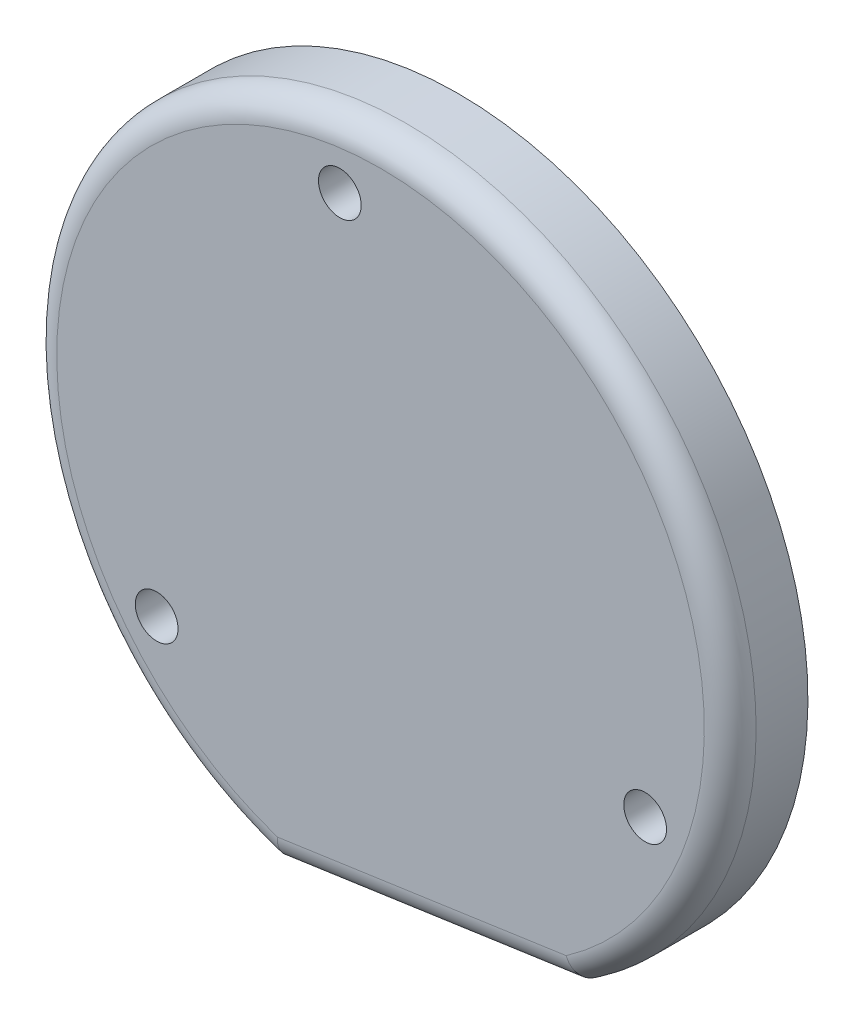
ISO-10303-21;
HEADER;
FILE_DESCRIPTION(('STEP AP214'),'2;1');
FILE_NAME('part.step','',(''),(''),'','','');
FILE_SCHEMA(('AUTOMOTIVE_DESIGN { 1 0 10303 214 1 1 1 1 }'));
ENDSEC;
DATA;
#1=APPLICATION_CONTEXT('core data for automotive mechanical design processes');
#2=APPLICATION_PROTOCOL_DEFINITION('international standard','automotive_design',2000,#1);
#3=PRODUCT_CONTEXT('',#1,'mechanical');
#4=PRODUCT('Part','Part','',(#3));
#5=PRODUCT_RELATED_PRODUCT_CATEGORY('part','',(#4));
#6=PRODUCT_DEFINITION_FORMATION('','',#4);
#7=PRODUCT_DEFINITION_CONTEXT('part definition',#1,'design');
#8=PRODUCT_DEFINITION('design','',#6,#7);
#9=PRODUCT_DEFINITION_SHAPE('','',#8);
#10=(LENGTH_UNIT() NAMED_UNIT(*) SI_UNIT(.MILLI.,.METRE.));
#11=(NAMED_UNIT(*) PLANE_ANGLE_UNIT() SI_UNIT($,.RADIAN.));
#12=(NAMED_UNIT(*) SI_UNIT($,.STERADIAN.) SOLID_ANGLE_UNIT());
#13=UNCERTAINTY_MEASURE_WITH_UNIT(LENGTH_MEASURE(1.E-05),#10,'distance_accuracy_value','');
#14=(GEOMETRIC_REPRESENTATION_CONTEXT(3) GLOBAL_UNCERTAINTY_ASSIGNED_CONTEXT((#13)) GLOBAL_UNIT_ASSIGNED_CONTEXT((#10,
#11,#12)) REPRESENTATION_CONTEXT('',''));
#15=CARTESIAN_POINT('',(0.,0.,0.));
#16=DIRECTION('',(0.,0.,1.));
#17=DIRECTION('',(1.,0.,0.));
#18=AXIS2_PLACEMENT_3D('',#15,#16,#17);
#19=CARTESIAN_POINT('',(0.,0.,56.2474746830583));
#20=DIRECTION('',(0.,0.,-1.));
#21=DIRECTION('',(-1.,0.,0.));
#22=AXIS2_PLACEMENT_3D('',#19,#20,#21);
#23=CYLINDRICAL_SURFACE('',#22,17.5);
#24=CARTESIAN_POINT('',(0.,0.,0.));
#25=DIRECTION('',(0.,0.,1.));
#26=DIRECTION('',(1.,0.,0.));
#27=AXIS2_PLACEMENT_3D('',#24,#25,#26);
#28=CIRCLE('',#27,17.5);
#29=CARTESIAN_POINT('',(17.5,0.,0.));
#30=VERTEX_POINT('',#29);
#31=EDGE_CURVE('E101',#30,#30,#28,.T.);
#32=ORIENTED_EDGE('',*,*,#31,.T.);
#33=EDGE_LOOP('',(#32));
#34=FACE_BOUND('',#33,.T.);
#35=CARTESIAN_POINT('',(0.,0.,4.75000000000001));
#36=DIRECTION('',(0.,0.,1.));
#37=DIRECTION('',(0.,-1.,0.));
#38=AXIS2_PLACEMENT_3D('',#35,#36,#37);
#39=CIRCLE('',#38,17.5);
#40=CARTESIAN_POINT('',(0.,-17.5,4.75000000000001));
#41=VERTEX_POINT('',#40);
#42=EDGE_CURVE('E97',#41,#41,#39,.T.);
#43=ORIENTED_EDGE('',*,*,#42,.F.);
#44=EDGE_LOOP('',(#43));
#45=FACE_BOUND('',#44,.T.);
#46=ADVANCED_FACE('F31',(#34,#45),#23,.T.);
#47=CARTESIAN_POINT('',(0.,0.,0.));
#48=DIRECTION('',(0.,0.,1.));
#49=DIRECTION('',(1.,0.,0.));
#50=AXIS2_PLACEMENT_3D('',#47,#48,#49);
#51=PLANE('',#50);
#52=ORIENTED_EDGE('',*,*,#31,.F.);
#53=EDGE_LOOP('',(#52));
#54=FACE_BOUND('',#53,.T.);
#55=CARTESIAN_POINT('',(0.,0.,0.));
#56=DIRECTION('',(0.,0.,1.));
#57=DIRECTION('',(1.,0.,0.));
#58=AXIS2_PLACEMENT_3D('',#55,#56,#57);
#59=CIRCLE('',#58,13.204);
#60=CARTESIAN_POINT('',(13.204,0.,0.));
#61=VERTEX_POINT('',#60);
#62=EDGE_CURVE('E96',#61,#61,#59,.T.);
#63=ORIENTED_EDGE('',*,*,#62,.T.);
#64=EDGE_LOOP('',(#63));
#65=FACE_BOUND('',#64,.T.);
#66=ADVANCED_FACE('F121',(#54,#65),#51,.F.);
#67=CARTESIAN_POINT('',(0.,0.,56.2474746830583));
#68=DIRECTION('',(0.,0.,-1.));
#69=DIRECTION('',(-1.,0.,0.));
#70=AXIS2_PLACEMENT_3D('',#67,#68,#69);
#71=CYLINDRICAL_SURFACE('',#70,13.204);
#72=ORIENTED_EDGE('',*,*,#62,.F.);
#73=EDGE_LOOP('',(#72));
#74=FACE_BOUND('',#73,.T.);
#75=CARTESIAN_POINT('',(0.,0.,4.75000000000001));
#76=DIRECTION('',(0.,0.,1.));
#77=DIRECTION('',(1.,0.,0.));
#78=AXIS2_PLACEMENT_3D('',#75,#76,#77);
#79=CIRCLE('',#78,13.204);
#80=CARTESIAN_POINT('',(13.204,0.,4.75000000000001));
#81=VERTEX_POINT('',#80);
#82=EDGE_CURVE('E77',#81,#81,#79,.T.);
#83=ORIENTED_EDGE('',*,*,#82,.T.);
#84=EDGE_LOOP('',(#83));
#85=FACE_BOUND('',#84,.T.);
#86=ADVANCED_FACE('F125',(#74,#85),#71,.F.);
#87=CARTESIAN_POINT('',(0.,0.,4.75000000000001));
#88=DIRECTION('',(0.,0.,1.));
#89=DIRECTION('',(1.,0.,0.));
#90=AXIS2_PLACEMENT_3D('',#87,#88,#89);
#91=PLANE('',#90);
#92=ORIENTED_EDGE('',*,*,#82,.F.);
#93=EDGE_LOOP('',(#92));
#94=FACE_BOUND('',#93,.T.);
#95=ADVANCED_FACE('F129',(#94),#91,.F.);
#96=CARTESIAN_POINT('',(-3.14288312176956,21.7743492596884,4.75000000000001));
#97=DIRECTION('',(0.,0.,1.));
#98=DIRECTION('',(1.,0.,0.));
#99=AXIS2_PLACEMENT_3D('',#96,#97,#98);
#100=CIRCLE('',#99,1.64999999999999);
#101=CARTESIAN_POINT('',(-1.49288312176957,21.7743492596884,4.75000000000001));
#102=VERTEX_POINT('',#101);
#103=EDGE_CURVE('E163',#102,#102,#100,.T.);
#104=ORIENTED_EDGE('',*,*,#103,.T.);
#105=EDGE_LOOP('',(#104));
#106=FACE_BOUND('',#105,.T.);
#107=CARTESIAN_POINT('',(20.4285811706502,-8.16535800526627,4.75000000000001));
#108=DIRECTION('',(0.,0.,1.));
#109=DIRECTION('',(1.,0.,0.));
#110=AXIS2_PLACEMENT_3D('',#107,#108,#109);
#111=CIRCLE('',#110,1.64999999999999);
#112=CARTESIAN_POINT('',(22.0785811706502,-8.16535800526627,4.75000000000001));
#113=VERTEX_POINT('',#112);
#114=EDGE_CURVE('E168',#113,#113,#111,.T.);
#115=ORIENTED_EDGE('',*,*,#114,.T.);
#116=EDGE_LOOP('',(#115));
#117=FACE_BOUND('',#116,.T.);
#118=CARTESIAN_POINT('',(-17.28569804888,-13.6089912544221,4.75000000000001));
#119=DIRECTION('',(0.,0.,1.));
#120=DIRECTION('',(1.,0.,0.));
#121=AXIS2_PLACEMENT_3D('',#118,#119,#120);
#122=CIRCLE('',#121,1.64999999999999);
#123=CARTESIAN_POINT('',(-15.63569804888,-13.6089912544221,4.75000000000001));
#124=VERTEX_POINT('',#123);
#125=EDGE_CURVE('E86',#124,#124,#122,.T.);
#126=ORIENTED_EDGE('',*,*,#125,.T.);
#127=EDGE_LOOP('',(#126));
#128=FACE_BOUND('',#127,.T.);
#129=CARTESIAN_POINT('',(0.,0.,4.75000000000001));
#130=DIRECTION('',(0.,0.,1.));
#131=DIRECTION('',(1.,0.,0.));
#132=AXIS2_PLACEMENT_3D('',#129,#130,#131);
#133=CIRCLE('',#132,27.);
#134=CARTESIAN_POINT('',(15.0836435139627,-22.3938317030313,4.75000000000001));
#135=VERTEX_POINT('',#134);
#136=CARTESIAN_POINT('',(-8.13531021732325,-25.7452272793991,4.75000000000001));
#137=VERTEX_POINT('',#136);
#138=EDGE_CURVE('E83',#135,#137,#133,.T.);
#139=ORIENTED_EDGE('',*,*,#138,.F.);
#140=DIRECTION('',(0.989743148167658,0.142858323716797,0.));
#141=VECTOR('',#140,1.);
#142=CARTESIAN_POINT('',(15.0836435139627,-22.3938317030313,4.75000000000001));
#143=LINE('',#142,#141);
#144=EDGE_CURVE('E74',#137,#135,#143,.T.);
#145=ORIENTED_EDGE('',*,*,#144,.F.);
#146=EDGE_LOOP('',(#139,#145));
#147=FACE_BOUND('',#146,.T.);
#148=ORIENTED_EDGE('',*,*,#42,.T.);
#149=EDGE_LOOP('',(#148));
#150=FACE_BOUND('',#149,.T.);
#151=ADVANCED_FACE('F81',(#106,#117,#128,#147,#150),#91,.F.);
#152=CARTESIAN_POINT('',(0.,0.,10.75));
#153=DIRECTION('',(0.,0.,-1.));
#154=DIRECTION('',(-1.,0.,0.));
#155=AXIS2_PLACEMENT_3D('',#152,#153,#154);
#156=CYLINDRICAL_SURFACE('',#155,27.);
#157=DIRECTION('',(0.,0.,-1.));
#158=VECTOR('',#157,1.);
#159=CARTESIAN_POINT('',(-8.13531021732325,-25.7452272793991,10.75));
#160=LINE('',#159,#158);
#161=CARTESIAN_POINT('',(-8.13531021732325,-25.7452272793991,8.75000000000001));
#162=VERTEX_POINT('',#161);
#163=EDGE_CURVE('E71',#162,#137,#160,.T.);
#164=ORIENTED_EDGE('',*,*,#163,.F.);
#165=CARTESIAN_POINT('',(0.,0.,8.75000000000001));
#166=DIRECTION('',(0.,0.,1.));
#167=DIRECTION('',(1.,0.,0.));
#168=AXIS2_PLACEMENT_3D('',#165,#166,#167);
#169=CIRCLE('',#168,27.);
#170=CARTESIAN_POINT('',(15.0836435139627,-22.3938317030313,8.75000000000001));
#171=VERTEX_POINT('',#170);
#172=EDGE_CURVE('E11',#162,#171,#169,.F.);
#173=ORIENTED_EDGE('',*,*,#172,.T.);
#174=DIRECTION('',(0.,0.,-1.));
#175=VECTOR('',#174,1.);
#176=CARTESIAN_POINT('',(15.0836435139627,-22.3938317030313,10.75));
#177=LINE('',#176,#175);
#178=EDGE_CURVE('E78',#171,#135,#177,.T.);
#179=ORIENTED_EDGE('',*,*,#178,.T.);
#180=ORIENTED_EDGE('',*,*,#138,.T.);
#181=EDGE_LOOP('',(#164,#173,#179,#180));
#182=FACE_BOUND('',#181,.T.);
#183=ADVANCED_FACE('F85',(#182),#156,.T.);
#184=CARTESIAN_POINT('',(15.0836435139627,-22.3938317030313,10.75));
#185=DIRECTION('',(-0.142858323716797,0.989743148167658,0.));
#186=DIRECTION('',(-0.989743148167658,-0.142858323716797,0.));
#187=AXIS2_PLACEMENT_3D('',#184,#185,#186);
#188=PLANE('',#187);
#189=ORIENTED_EDGE('',*,*,#178,.F.);
#190=DIRECTION('',(0.989743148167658,0.142858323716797,0.));
#191=VECTOR('',#190,1.);
#192=CARTESIAN_POINT('',(-8.13531021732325,-25.7452272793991,8.75000000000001));
#193=LINE('',#192,#191);
#194=EDGE_CURVE('E44',#171,#162,#193,.F.);
#195=ORIENTED_EDGE('',*,*,#194,.T.);
#196=ORIENTED_EDGE('',*,*,#163,.T.);
#197=ORIENTED_EDGE('',*,*,#144,.T.);
#198=EDGE_LOOP('',(#189,#195,#196,#197));
#199=FACE_BOUND('',#198,.T.);
#200=ADVANCED_FACE('F73',(#199),#188,.F.);
#201=CARTESIAN_POINT('',(0.,0.,10.75));
#202=DIRECTION('',(0.,0.,1.));
#203=DIRECTION('',(1.,0.,0.));
#204=AXIS2_PLACEMENT_3D('',#201,#202,#203);
#205=PLANE('',#204);
#206=CARTESIAN_POINT('',(0.,0.,10.75));
#207=DIRECTION('',(0.,0.,1.));
#208=DIRECTION('',(1.,0.,0.));
#209=AXIS2_PLACEMENT_3D('',#206,#207,#208);
#210=CIRCLE('',#209,25.);
#211=CARTESIAN_POINT('',(14.3363053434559,-20.4809752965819,10.75));
#212=VERTEX_POINT('',#211);
#213=CARTESIAN_POINT('',(-7.95940534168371,-23.6991110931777,10.75));
#214=VERTEX_POINT('',#213);
#215=EDGE_CURVE('E100',#212,#214,#210,.T.);
#216=ORIENTED_EDGE('',*,*,#215,.T.);
#217=DIRECTION('',(0.989743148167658,0.142858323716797,0.));
#218=VECTOR('',#217,1.);
#219=CARTESIAN_POINT('',(14.7979268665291,-20.414345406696,10.75));
#220=LINE('',#219,#218);
#221=EDGE_CURVE('E107',#214,#212,#220,.T.);
#222=ORIENTED_EDGE('',*,*,#221,.T.);
#223=EDGE_LOOP('',(#216,#222));
#224=FACE_BOUND('',#223,.T.);
#225=CARTESIAN_POINT('',(-3.14288312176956,21.7743492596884,10.75));
#226=DIRECTION('',(0.,0.,1.));
#227=DIRECTION('',(1.,0.,0.));
#228=AXIS2_PLACEMENT_3D('',#225,#226,#227);
#229=CIRCLE('',#228,1.64999999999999);
#230=CARTESIAN_POINT('',(-1.49288312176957,21.7743492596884,10.75));
#231=VERTEX_POINT('',#230);
#232=EDGE_CURVE('E160',#231,#231,#229,.T.);
#233=ORIENTED_EDGE('',*,*,#232,.F.);
#234=EDGE_LOOP('',(#233));
#235=FACE_BOUND('',#234,.T.);
#236=CARTESIAN_POINT('',(20.4285811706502,-8.16535800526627,10.75));
#237=DIRECTION('',(0.,0.,1.));
#238=DIRECTION('',(1.,0.,0.));
#239=AXIS2_PLACEMENT_3D('',#236,#237,#238);
#240=CIRCLE('',#239,1.64999999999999);
#241=CARTESIAN_POINT('',(22.0785811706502,-8.16535800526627,10.75));
#242=VERTEX_POINT('',#241);
#243=EDGE_CURVE('E165',#242,#242,#240,.T.);
#244=ORIENTED_EDGE('',*,*,#243,.F.);
#245=EDGE_LOOP('',(#244));
#246=FACE_BOUND('',#245,.T.);
#247=CARTESIAN_POINT('',(-17.28569804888,-13.6089912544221,10.75));
#248=DIRECTION('',(0.,0.,1.));
#249=DIRECTION('',(1.,0.,0.));
#250=AXIS2_PLACEMENT_3D('',#247,#248,#249);
#251=CIRCLE('',#250,1.64999999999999);
#252=CARTESIAN_POINT('',(-15.63569804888,-13.6089912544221,10.75));
#253=VERTEX_POINT('',#252);
#254=EDGE_CURVE('E89',#253,#253,#251,.T.);
#255=ORIENTED_EDGE('',*,*,#254,.F.);
#256=EDGE_LOOP('',(#255));
#257=FACE_BOUND('',#256,.T.);
#258=ADVANCED_FACE('F135',(#224,#235,#246,#257),#205,.T.);
#259=CARTESIAN_POINT('',(-17.28569804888,-13.6089912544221,10.75));
#260=DIRECTION('',(0.,0.,1.));
#261=DIRECTION('',(1.,0.,0.));
#262=AXIS2_PLACEMENT_3D('',#259,#260,#261);
#263=CYLINDRICAL_SURFACE('',#262,1.64999999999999);
#264=ORIENTED_EDGE('',*,*,#254,.T.);
#265=EDGE_LOOP('',(#264));
#266=FACE_BOUND('',#265,.T.);
#267=ORIENTED_EDGE('',*,*,#125,.F.);
#268=EDGE_LOOP('',(#267));
#269=FACE_BOUND('',#268,.T.);
#270=ADVANCED_FACE('F141',(#266,#269),#263,.F.);
#271=CARTESIAN_POINT('',(20.4285811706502,-8.16535800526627,10.75));
#272=DIRECTION('',(0.,0.,1.));
#273=DIRECTION('',(1.,0.,0.));
#274=AXIS2_PLACEMENT_3D('',#271,#272,#273);
#275=CYLINDRICAL_SURFACE('',#274,1.64999999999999);
#276=ORIENTED_EDGE('',*,*,#243,.T.);
#277=EDGE_LOOP('',(#276));
#278=FACE_BOUND('',#277,.T.);
#279=ORIENTED_EDGE('',*,*,#114,.F.);
#280=EDGE_LOOP('',(#279));
#281=FACE_BOUND('',#280,.T.);
#282=ADVANCED_FACE('F145',(#278,#281),#275,.F.);
#283=CARTESIAN_POINT('',(-3.14288312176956,21.7743492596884,10.75));
#284=DIRECTION('',(0.,0.,1.));
#285=DIRECTION('',(1.,0.,0.));
#286=AXIS2_PLACEMENT_3D('',#283,#284,#285);
#287=CYLINDRICAL_SURFACE('',#286,1.64999999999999);
#288=ORIENTED_EDGE('',*,*,#232,.T.);
#289=EDGE_LOOP('',(#288));
#290=FACE_BOUND('',#289,.T.);
#291=ORIENTED_EDGE('',*,*,#103,.F.);
#292=EDGE_LOOP('',(#291));
#293=FACE_BOUND('',#292,.T.);
#294=ADVANCED_FACE('F149',(#290,#293),#287,.F.);
#295=CARTESIAN_POINT('',(0.,0.,8.75000000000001));
#296=DIRECTION('',(0.,0.,1.));
#297=DIRECTION('',(1.,0.,0.));
#298=AXIS2_PLACEMENT_3D('',#295,#296,#297);
#299=TOROIDAL_SURFACE('',#298,25.,2.);
#300=CARTESIAN_POINT('',(15.0836435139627,-22.3938317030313,8.75000000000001));
#301=CARTESIAN_POINT('',(15.0836435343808,-22.3938320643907,8.8052308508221));
#302=CARTESIAN_POINT('',(15.0827985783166,-22.3916406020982,8.86043488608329));
#303=CARTESIAN_POINT('',(15.0794287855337,-22.3829027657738,8.97044023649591));
#304=CARTESIAN_POINT('',(15.0769041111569,-22.3763568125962,9.02524159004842));
#305=CARTESIAN_POINT('',(15.0668406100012,-22.3502691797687,9.18828723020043));
#306=CARTESIAN_POINT('',(15.0568121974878,-22.324277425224,9.2954267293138));
#307=CARTESIAN_POINT('',(15.0304175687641,-22.2559253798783,9.50348335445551));
#308=CARTESIAN_POINT('',(15.014049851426,-22.2135612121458,9.60439900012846));
#309=CARTESIAN_POINT('',(14.9754650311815,-22.1138087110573,9.79728910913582));
#310=CARTESIAN_POINT('',(14.9532481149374,-22.0564208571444,9.88926385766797));
#311=CARTESIAN_POINT('',(14.9033417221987,-21.9276944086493,10.0627668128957));
#312=CARTESIAN_POINT('',(14.8755967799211,-21.8562145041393,10.1441740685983));
#313=CARTESIAN_POINT('',(14.8155620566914,-21.7018093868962,10.2933462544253));
#314=CARTESIAN_POINT('',(14.7832707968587,-21.6188804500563,10.3611067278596));
#315=CARTESIAN_POINT('',(14.7142058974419,-21.4418507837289,10.4827794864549));
#316=CARTESIAN_POINT('',(14.6773431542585,-21.347529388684,10.5363196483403));
#317=CARTESIAN_POINT('',(14.6007866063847,-21.1520619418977,10.6260753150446));
#318=CARTESIAN_POINT('',(14.5610938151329,-21.0509183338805,10.6622969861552));
#319=CARTESIAN_POINT('',(14.4912714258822,-20.8734003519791,10.7090598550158));
#320=CARTESIAN_POINT('',(14.461555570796,-20.7979687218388,10.7239429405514));
#321=CARTESIAN_POINT('',(14.4016382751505,-20.646124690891,10.744124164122));
#322=CARTESIAN_POINT('',(14.3714378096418,-20.5697143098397,10.7494395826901));
#323=CARTESIAN_POINT('',(14.3395757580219,-20.4892348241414,10.7499860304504));
#324=CARTESIAN_POINT('',(14.337940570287,-20.4851049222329,10.7500000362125));
#325=CARTESIAN_POINT('',(14.3363053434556,-20.4809752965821,10.75));
#326=B_SPLINE_CURVE_WITH_KNOTS('',3,(#300,#301,#302,#303,#304,#305,#306,#307,#308,#309,#310,
#311,#312,#313,#314,#315,#316,#317,#318,#319,#320,#321,#322,#323,#324,#325),.UNSPECIFIED.,.F.,
.F.,(4,2,2,2,2,2,2,2,2,2,2,2,4),(0.,0.165589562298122,0.331163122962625,0.661559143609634,
0.992033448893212,1.32249720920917,1.65646077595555,1.99053323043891,2.33263781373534,
2.67462049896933,2.921403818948,3.16774096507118,3.18106644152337),.UNSPECIFIED.);
#327=EDGE_CURVE('E110',#171,#212,#326,.T.);
#328=ORIENTED_EDGE('',*,*,#327,.F.);
#329=ORIENTED_EDGE('',*,*,#172,.F.);
#330=CARTESIAN_POINT('',(-8.13531021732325,-25.7452272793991,8.75000000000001));
#331=CARTESIAN_POINT('',(-8.13531013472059,-25.7452276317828,8.8052308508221));
#332=CARTESIAN_POINT('',(-8.1351193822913,-25.7428866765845,8.86043488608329));
#333=CARTESIAN_POINT('',(-8.13435807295,-25.7335525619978,8.97044023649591));
#334=CARTESIAN_POINT('',(-8.13378755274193,-25.7265598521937,9.02524159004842));
#335=CARTESIAN_POINT('',(-8.13151203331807,-25.6986912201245,9.18828723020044));
#336=CARTESIAN_POINT('',(-8.12924305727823,-25.6709244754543,9.2954267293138));
#337=CARTESIAN_POINT('',(-8.12325478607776,-25.5978983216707,9.50348335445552));
#338=CARTESIAN_POINT('',(-8.11953514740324,-25.5526347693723,9.60439900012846));
#339=CARTESIAN_POINT('',(-8.11073386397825,-25.4460426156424,9.79728910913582));
#340=CARTESIAN_POINT('',(-8.10565226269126,-25.38471452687,9.88926385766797));
#341=CARTESIAN_POINT('',(-8.0941849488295,-25.2471294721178,10.0627668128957));
#342=CARTESIAN_POINT('',(-8.08778599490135,-25.1707212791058,10.1441740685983));
#343=CARTESIAN_POINT('',(-8.07386532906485,-25.0056415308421,10.2933462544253));
#344=CARTESIAN_POINT('',(-8.06634325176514,-24.9169659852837,10.3611067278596));
#345=CARTESIAN_POINT('',(-8.05015890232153,-24.7276315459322,10.4827794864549));
#346=CARTESIAN_POINT('',(-8.04147356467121,-24.6267357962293,10.5363196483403));
#347=CARTESIAN_POINT('',(-8.02331730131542,-24.4175976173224,10.6260753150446));
#348=CARTESIAN_POINT('',(-8.01384665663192,-24.3093578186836,10.6622969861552));
#349=CARTESIAN_POINT('',(-7.99707382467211,-24.1193407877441,10.7090598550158));
#350=CARTESIAN_POINT('',(-7.98990189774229,-24.038584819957,10.7239429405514));
#351=CARTESIAN_POINT('',(-7.97536962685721,-23.8759948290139,10.744124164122));
#352=CARTESIAN_POINT('',(-7.96800964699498,-23.7941630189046,10.7494395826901));
#353=CARTESIAN_POINT('',(-7.96020658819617,-23.7079583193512,10.7499860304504));
#354=CARTESIAN_POINT('',(-7.95980602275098,-23.7035345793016,10.7500000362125));
#355=CARTESIAN_POINT('',(-7.95940534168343,-23.6991110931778,10.75));
#356=B_SPLINE_CURVE_WITH_KNOTS('',3,(#330,#331,#332,#333,#334,#335,#336,#337,#338,#339,#340,
#341,#342,#343,#344,#345,#346,#347,#348,#349,#350,#351,#352,#353,#354,#355),.UNSPECIFIED.,.F.,
.F.,(4,2,2,2,2,2,2,2,2,2,2,2,4),(0.,0.165589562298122,0.331163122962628,0.661559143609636,
0.992033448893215,1.32249720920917,1.65646077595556,1.99053323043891,2.33263781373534,
2.67462049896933,2.921403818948,3.16774096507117,3.18106644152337),.UNSPECIFIED.);
#357=EDGE_CURVE('E36',#214,#162,#356,.F.);
#358=ORIENTED_EDGE('',*,*,#357,.F.);
#359=ORIENTED_EDGE('',*,*,#215,.F.);
#360=EDGE_LOOP('',(#328,#329,#358,#359));
#361=FACE_BOUND('',#360,.T.);
#362=ADVANCED_FACE('F33',(#361),#299,.T.);
#363=CARTESIAN_POINT('',(3.18845000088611,-22.0900431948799,8.75000000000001));
#364=DIRECTION('',(-0.989743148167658,-0.142858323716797,0.));
#365=DIRECTION('',(0.142858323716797,-0.989743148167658,0.));
#366=AXIS2_PLACEMENT_3D('',#363,#364,#365);
#367=CYLINDRICAL_SURFACE('',#366,2.);
#368=ORIENTED_EDGE('',*,*,#357,.T.);
#369=ORIENTED_EDGE('',*,*,#194,.F.);
#370=ORIENTED_EDGE('',*,*,#327,.T.);
#371=ORIENTED_EDGE('',*,*,#221,.F.);
#372=EDGE_LOOP('',(#368,#369,#370,#371));
#373=FACE_BOUND('',#372,.T.);
#374=ADVANCED_FACE('F114',(#373),#367,.T.);
#375=CLOSED_SHELL('',(#46,#66,#86,#95,#151,#183,#200,#258,#270,#282,#294,#362,#374));
#376=MANIFOLD_SOLID_BREP('B2',#375);
#377=ADVANCED_BREP_SHAPE_REPRESENTATION('',(#18,#376),#14);
#378=SHAPE_DEFINITION_REPRESENTATION(#9,#377);
ENDSEC;
END-ISO-10303-21;
